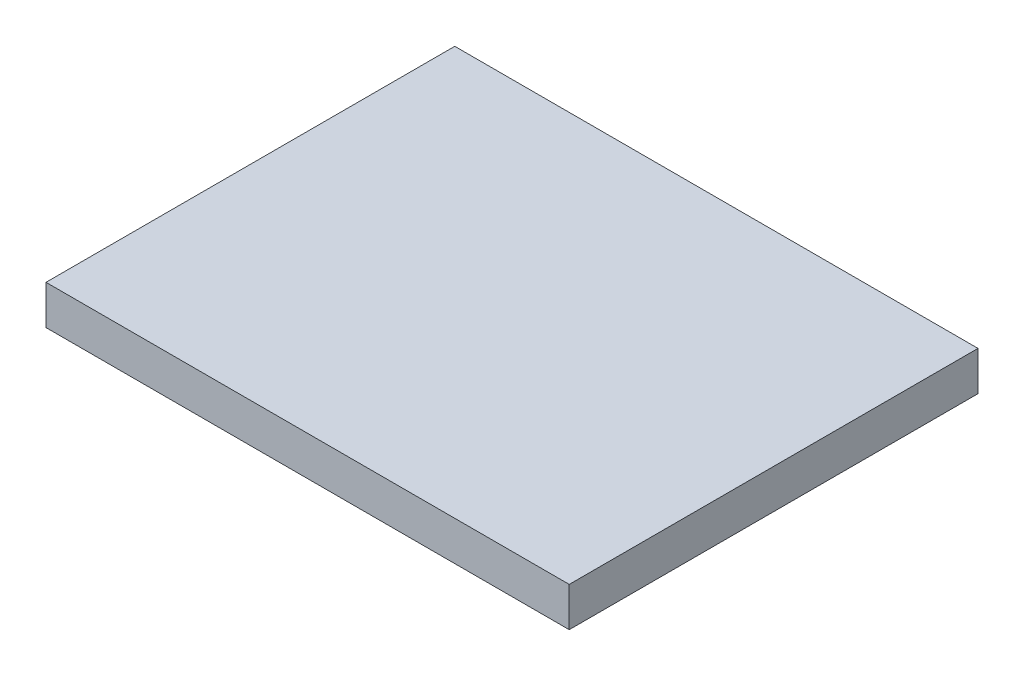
ISO-10303-21;
HEADER;
FILE_DESCRIPTION(('STEP AP214'),'2;1');
FILE_NAME('part.step','',(''),(''),'','','');
FILE_SCHEMA(('AUTOMOTIVE_DESIGN { 1 0 10303 214 1 1 1 1 }'));
ENDSEC;
DATA;
#1=APPLICATION_CONTEXT('core data for automotive mechanical design processes');
#2=APPLICATION_PROTOCOL_DEFINITION('international standard','automotive_design',2000,#1);
#3=PRODUCT_CONTEXT('',#1,'mechanical');
#4=PRODUCT('Part','Part','',(#3));
#5=PRODUCT_RELATED_PRODUCT_CATEGORY('part','',(#4));
#6=PRODUCT_DEFINITION_FORMATION('','',#4);
#7=PRODUCT_DEFINITION_CONTEXT('part definition',#1,'design');
#8=PRODUCT_DEFINITION('design','',#6,#7);
#9=PRODUCT_DEFINITION_SHAPE('','',#8);
#10=(LENGTH_UNIT() NAMED_UNIT(*) SI_UNIT(.MILLI.,.METRE.));
#11=(NAMED_UNIT(*) PLANE_ANGLE_UNIT() SI_UNIT($,.RADIAN.));
#12=(NAMED_UNIT(*) SI_UNIT($,.STERADIAN.) SOLID_ANGLE_UNIT());
#13=UNCERTAINTY_MEASURE_WITH_UNIT(LENGTH_MEASURE(1.E-05),#10,'distance_accuracy_value','');
#14=(GEOMETRIC_REPRESENTATION_CONTEXT(3) GLOBAL_UNCERTAINTY_ASSIGNED_CONTEXT((#13)) GLOBAL_UNIT_ASSIGNED_CONTEXT((#10,
#11,#12)) REPRESENTATION_CONTEXT('',''));
#15=CARTESIAN_POINT('',(0.,0.,0.));
#16=DIRECTION('',(0.,0.,1.));
#17=DIRECTION('',(1.,0.,0.));
#18=AXIS2_PLACEMENT_3D('',#15,#16,#17);
#19=CARTESIAN_POINT('',(-40.,6.,31.25));
#20=DIRECTION('',(1.,0.,0.));
#21=DIRECTION('',(0.,0.,-1.));
#22=AXIS2_PLACEMENT_3D('',#19,#20,#21);
#23=PLANE('',#22);
#24=DIRECTION('',(0.,0.,1.));
#25=VECTOR('',#24,1.);
#26=CARTESIAN_POINT('',(-40.,0.,31.25));
#27=LINE('',#26,#25);
#28=CARTESIAN_POINT('',(-40.,0.,-31.25));
#29=VERTEX_POINT('',#28);
#30=CARTESIAN_POINT('',(-40.,0.,31.25));
#31=VERTEX_POINT('',#30);
#32=EDGE_CURVE('E96',#29,#31,#27,.T.);
#33=ORIENTED_EDGE('',*,*,#32,.T.);
#34=DIRECTION('',(0.,-1.,0.));
#35=VECTOR('',#34,1.);
#36=CARTESIAN_POINT('',(-40.,6.,31.25));
#37=LINE('',#36,#35);
#38=CARTESIAN_POINT('',(-40.,6.,31.25));
#39=VERTEX_POINT('',#38);
#40=EDGE_CURVE('E11',#39,#31,#37,.T.);
#41=ORIENTED_EDGE('',*,*,#40,.F.);
#42=DIRECTION('',(0.,0.,1.));
#43=VECTOR('',#42,1.);
#44=CARTESIAN_POINT('',(-40.,6.,31.25));
#45=LINE('',#44,#43);
#46=CARTESIAN_POINT('',(-40.,6.,-31.25));
#47=VERTEX_POINT('',#46);
#48=EDGE_CURVE('E84',#47,#39,#45,.T.);
#49=ORIENTED_EDGE('',*,*,#48,.F.);
#50=DIRECTION('',(0.,-1.,0.));
#51=VECTOR('',#50,1.);
#52=CARTESIAN_POINT('',(-40.,6.,-31.25));
#53=LINE('',#52,#51);
#54=EDGE_CURVE('E92',#47,#29,#53,.T.);
#55=ORIENTED_EDGE('',*,*,#54,.T.);
#56=EDGE_LOOP('',(#33,#41,#49,#55));
#57=FACE_BOUND('',#56,.T.);
#58=ADVANCED_FACE('F33',(#57),#23,.F.);
#59=CARTESIAN_POINT('',(40.,6.,31.25));
#60=DIRECTION('',(0.,0.,-1.));
#61=DIRECTION('',(-1.,0.,0.));
#62=AXIS2_PLACEMENT_3D('',#59,#60,#61);
#63=PLANE('',#62);
#64=DIRECTION('',(1.,0.,0.));
#65=VECTOR('',#64,1.);
#66=CARTESIAN_POINT('',(40.,0.,31.25));
#67=LINE('',#66,#65);
#68=CARTESIAN_POINT('',(40.,0.,31.25));
#69=VERTEX_POINT('',#68);
#70=EDGE_CURVE('E88',#31,#69,#67,.T.);
#71=ORIENTED_EDGE('',*,*,#70,.T.);
#72=DIRECTION('',(0.,-1.,0.));
#73=VECTOR('',#72,1.);
#74=CARTESIAN_POINT('',(40.,6.,31.25));
#75=LINE('',#74,#73);
#76=CARTESIAN_POINT('',(40.,6.,31.25));
#77=VERTEX_POINT('',#76);
#78=EDGE_CURVE('E41',#77,#69,#75,.T.);
#79=ORIENTED_EDGE('',*,*,#78,.F.);
#80=DIRECTION('',(1.,0.,0.));
#81=VECTOR('',#80,1.);
#82=CARTESIAN_POINT('',(40.,6.,31.25));
#83=LINE('',#82,#81);
#84=EDGE_CURVE('E79',#39,#77,#83,.T.);
#85=ORIENTED_EDGE('',*,*,#84,.F.);
#86=ORIENTED_EDGE('',*,*,#40,.T.);
#87=EDGE_LOOP('',(#71,#79,#85,#86));
#88=FACE_BOUND('',#87,.T.);
#89=ADVANCED_FACE('F87',(#88),#63,.F.);
#90=CARTESIAN_POINT('',(40.,6.,31.25));
#91=DIRECTION('',(-1.,0.,0.));
#92=DIRECTION('',(0.,0.,1.));
#93=AXIS2_PLACEMENT_3D('',#90,#91,#92);
#94=PLANE('',#93);
#95=DIRECTION('',(0.,0.,-1.));
#96=VECTOR('',#95,1.);
#97=CARTESIAN_POINT('',(40.,0.,31.25));
#98=LINE('',#97,#96);
#99=CARTESIAN_POINT('',(40.,0.,-31.25));
#100=VERTEX_POINT('',#99);
#101=EDGE_CURVE('E66',#69,#100,#98,.T.);
#102=ORIENTED_EDGE('',*,*,#101,.T.);
#103=DIRECTION('',(0.,-1.,0.));
#104=VECTOR('',#103,1.);
#105=CARTESIAN_POINT('',(40.,6.,-31.25));
#106=LINE('',#105,#104);
#107=CARTESIAN_POINT('',(40.,6.,-31.25));
#108=VERTEX_POINT('',#107);
#109=EDGE_CURVE('E89',#108,#100,#106,.T.);
#110=ORIENTED_EDGE('',*,*,#109,.F.);
#111=DIRECTION('',(0.,0.,-1.));
#112=VECTOR('',#111,1.);
#113=CARTESIAN_POINT('',(40.,6.,31.25));
#114=LINE('',#113,#112);
#115=EDGE_CURVE('E82',#77,#108,#114,.T.);
#116=ORIENTED_EDGE('',*,*,#115,.F.);
#117=ORIENTED_EDGE('',*,*,#78,.T.);
#118=EDGE_LOOP('',(#102,#110,#116,#117));
#119=FACE_BOUND('',#118,.T.);
#120=ADVANCED_FACE('F90',(#119),#94,.F.);
#121=CARTESIAN_POINT('',(40.,6.,-31.25));
#122=DIRECTION('',(0.,0.,1.));
#123=DIRECTION('',(1.,0.,0.));
#124=AXIS2_PLACEMENT_3D('',#121,#122,#123);
#125=PLANE('',#124);
#126=DIRECTION('',(-1.,0.,0.));
#127=VECTOR('',#126,1.);
#128=CARTESIAN_POINT('',(40.,0.,-31.25));
#129=LINE('',#128,#127);
#130=EDGE_CURVE('E72',#100,#29,#129,.T.);
#131=ORIENTED_EDGE('',*,*,#130,.T.);
#132=ORIENTED_EDGE('',*,*,#54,.F.);
#133=DIRECTION('',(-1.,0.,0.));
#134=VECTOR('',#133,1.);
#135=CARTESIAN_POINT('',(40.,6.,-31.25));
#136=LINE('',#135,#134);
#137=EDGE_CURVE('E49',#108,#47,#136,.T.);
#138=ORIENTED_EDGE('',*,*,#137,.F.);
#139=ORIENTED_EDGE('',*,*,#109,.T.);
#140=EDGE_LOOP('',(#131,#132,#138,#139));
#141=FACE_BOUND('',#140,.T.);
#142=ADVANCED_FACE('F103',(#141),#125,.F.);
#143=CARTESIAN_POINT('',(0.,6.,0.));
#144=DIRECTION('',(0.,1.,0.));
#145=DIRECTION('',(0.,0.,1.));
#146=AXIS2_PLACEMENT_3D('',#143,#144,#145);
#147=PLANE('',#146);
#148=ORIENTED_EDGE('',*,*,#48,.T.);
#149=ORIENTED_EDGE('',*,*,#84,.T.);
#150=ORIENTED_EDGE('',*,*,#115,.T.);
#151=ORIENTED_EDGE('',*,*,#137,.T.);
#152=EDGE_LOOP('',(#148,#149,#150,#151));
#153=FACE_BOUND('',#152,.T.);
#154=ADVANCED_FACE('F80',(#153),#147,.T.);
#155=CARTESIAN_POINT('',(0.,0.,0.));
#156=DIRECTION('',(0.,1.,0.));
#157=DIRECTION('',(0.,0.,1.));
#158=AXIS2_PLACEMENT_3D('',#155,#156,#157);
#159=PLANE('',#158);
#160=ORIENTED_EDGE('',*,*,#32,.F.);
#161=ORIENTED_EDGE('',*,*,#130,.F.);
#162=ORIENTED_EDGE('',*,*,#101,.F.);
#163=ORIENTED_EDGE('',*,*,#70,.F.);
#164=EDGE_LOOP('',(#160,#161,#162,#163));
#165=FACE_BOUND('',#164,.T.);
#166=ADVANCED_FACE('F106',(#165),#159,.F.);
#167=CLOSED_SHELL('',(#58,#89,#120,#142,#154,#166));
#168=MANIFOLD_SOLID_BREP('B2',#167);
#169=ADVANCED_BREP_SHAPE_REPRESENTATION('',(#18,#168),#14);
#170=SHAPE_DEFINITION_REPRESENTATION(#9,#169);
ENDSEC;
END-ISO-10303-21;
